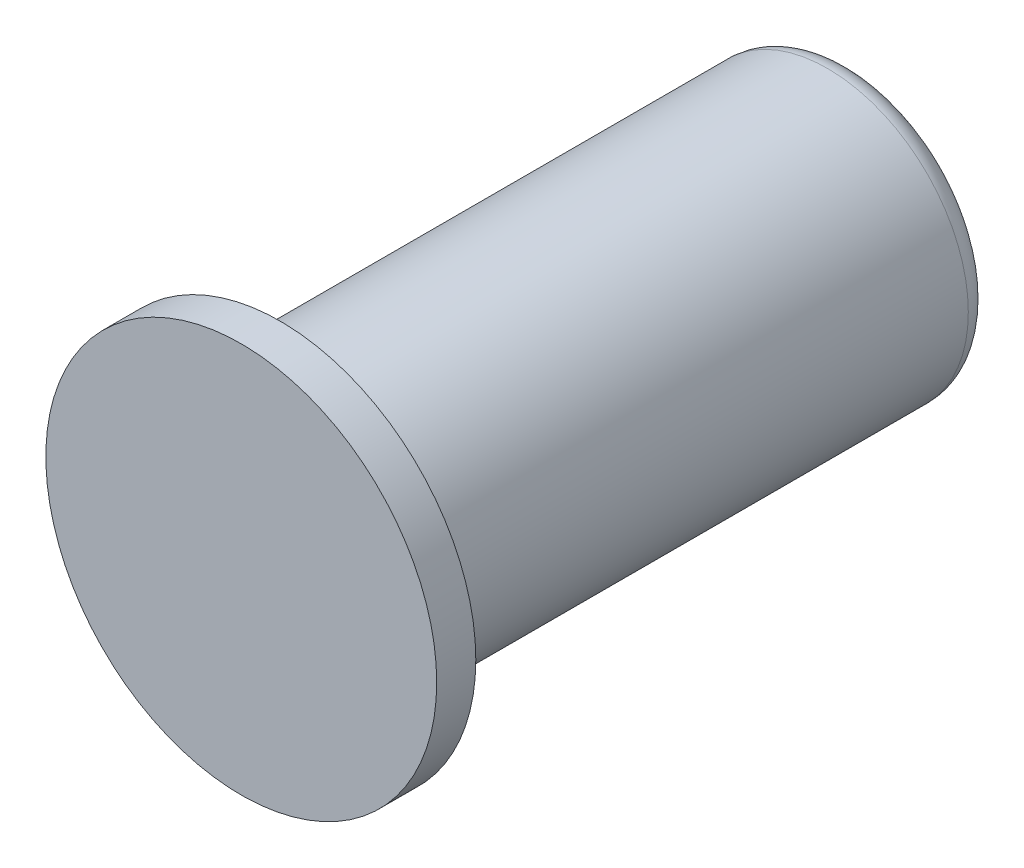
from build123d import *


with BuildPart() as part:
    # Sketch1 → Revolve1 (revolve)
    with BuildSketch(Plane(origin=(0, 0, 0), x_dir=(0, 0, -1), z_dir=(1, 0, 0)), mode=Mode.PRIVATE) as revolve1_sk:
        with BuildLine():
            Line((0, 0), (0, 25))
            Line((0, 25), (5, 25))
            Line((5, 25), (5, 18))
            Line((5, 18), (75, 18))
            ThreePointArc((75, 18), (77.121320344, 17.121320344), (78, 15))
            Line((78, 15), (78, 4.5))
            Line((78, 4.5), (77.5, 4))
            Line((77.5, 4), (69, 4))
            Line((69, 4), (66.690598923, 0))
            Line((66.690598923, 0), (0, 0))
        make_face()
    revolve(revolve1_sk.sketch.rotate(Axis((0, 0, 0), (0, 0, -1)), 90), axis=Axis((0, 0, 0), (0, 0, -1)))


solid = part.part
